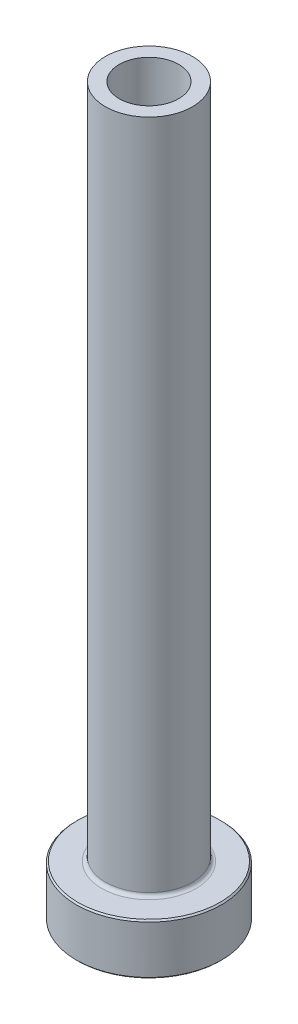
ISO-10303-21;
HEADER;
FILE_DESCRIPTION(('STEP AP214'),'2;1');
FILE_NAME('part.step','',(''),(''),'','','');
FILE_SCHEMA(('AUTOMOTIVE_DESIGN { 1 0 10303 214 1 1 1 1 }'));
ENDSEC;
DATA;
#1=APPLICATION_CONTEXT('core data for automotive mechanical design processes');
#2=APPLICATION_PROTOCOL_DEFINITION('international standard','automotive_design',2000,#1);
#3=PRODUCT_CONTEXT('',#1,'mechanical');
#4=PRODUCT('Part','Part','',(#3));
#5=PRODUCT_RELATED_PRODUCT_CATEGORY('part','',(#4));
#6=PRODUCT_DEFINITION_FORMATION('','',#4);
#7=PRODUCT_DEFINITION_CONTEXT('part definition',#1,'design');
#8=PRODUCT_DEFINITION('design','',#6,#7);
#9=PRODUCT_DEFINITION_SHAPE('','',#8);
#10=(LENGTH_UNIT() NAMED_UNIT(*) SI_UNIT(.MILLI.,.METRE.));
#11=(NAMED_UNIT(*) PLANE_ANGLE_UNIT() SI_UNIT($,.RADIAN.));
#12=(NAMED_UNIT(*) SI_UNIT($,.STERADIAN.) SOLID_ANGLE_UNIT());
#13=UNCERTAINTY_MEASURE_WITH_UNIT(LENGTH_MEASURE(1.E-05),#10,'distance_accuracy_value','');
#14=(GEOMETRIC_REPRESENTATION_CONTEXT(3) GLOBAL_UNCERTAINTY_ASSIGNED_CONTEXT((#13)) GLOBAL_UNIT_ASSIGNED_CONTEXT((#10,
#11,#12)) REPRESENTATION_CONTEXT('',''));
#15=CARTESIAN_POINT('',(0.,0.,0.));
#16=DIRECTION('',(0.,0.,1.));
#17=DIRECTION('',(1.,0.,0.));
#18=AXIS2_PLACEMENT_3D('',#15,#16,#17);
#19=CARTESIAN_POINT('',(0.,92.1876809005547,0.));
#20=DIRECTION('',(0.,1.,0.));
#21=DIRECTION('',(0.,0.,1.));
#22=AXIS2_PLACEMENT_3D('',#19,#20,#21);
#23=CYLINDRICAL_SURFACE('',#22,4.09999999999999);
#24=CARTESIAN_POINT('',(0.,100.,0.));
#25=DIRECTION('',(0.,1.,0.));
#26=DIRECTION('',(0.,0.,1.));
#27=AXIS2_PLACEMENT_3D('',#24,#25,#26);
#28=CIRCLE('',#27,4.09999999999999);
#29=CARTESIAN_POINT('',(0.,100.,4.09999999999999));
#30=VERTEX_POINT('',#29);
#31=EDGE_CURVE('E62',#30,#30,#28,.T.);
#32=ORIENTED_EDGE('',*,*,#31,.T.);
#33=EDGE_LOOP('',(#32));
#34=FACE_BOUND('',#33,.T.);
#35=CARTESIAN_POINT('',(0.,55.,0.));
#36=DIRECTION('',(0.,1.,0.));
#37=DIRECTION('',(0.,0.,1.));
#38=AXIS2_PLACEMENT_3D('',#35,#36,#37);
#39=CIRCLE('',#38,4.09999999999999);
#40=CARTESIAN_POINT('',(0.,55.,4.09999999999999));
#41=VERTEX_POINT('',#40);
#42=EDGE_CURVE('E71',#41,#41,#39,.T.);
#43=ORIENTED_EDGE('',*,*,#42,.F.);
#44=EDGE_LOOP('',(#43));
#45=FACE_BOUND('',#44,.T.);
#46=ADVANCED_FACE('F30',(#34,#45),#23,.F.);
#47=CARTESIAN_POINT('',(-4.09999999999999,100.,0.));
#48=DIRECTION('',(0.,1.,0.));
#49=DIRECTION('',(0.,0.,1.));
#50=AXIS2_PLACEMENT_3D('',#47,#48,#49);
#51=PLANE('',#50);
#52=CARTESIAN_POINT('',(0.,100.,0.));
#53=DIRECTION('',(0.,1.,0.));
#54=DIRECTION('',(0.,0.,1.));
#55=AXIS2_PLACEMENT_3D('',#52,#53,#54);
#56=CIRCLE('',#55,6.);
#57=CARTESIAN_POINT('',(0.,100.,6.));
#58=VERTEX_POINT('',#57);
#59=EDGE_CURVE('E65',#58,#58,#56,.T.);
#60=ORIENTED_EDGE('',*,*,#59,.T.);
#61=EDGE_LOOP('',(#60));
#62=FACE_BOUND('',#61,.T.);
#63=ORIENTED_EDGE('',*,*,#31,.F.);
#64=EDGE_LOOP('',(#63));
#65=FACE_BOUND('',#64,.T.);
#66=ADVANCED_FACE('F79',(#62,#65),#51,.T.);
#67=CARTESIAN_POINT('',(0.,92.1876809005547,0.));
#68=DIRECTION('',(0.,1.,0.));
#69=DIRECTION('',(0.,0.,1.));
#70=AXIS2_PLACEMENT_3D('',#67,#68,#69);
#71=CYLINDRICAL_SURFACE('',#70,6.);
#72=CARTESIAN_POINT('',(0.,7.50000000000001,0.));
#73=DIRECTION('',(0.,1.,0.));
#74=DIRECTION('',(0.,0.,1.));
#75=AXIS2_PLACEMENT_3D('',#72,#73,#74);
#76=CIRCLE('',#75,6.);
#77=CARTESIAN_POINT('',(0.,7.50000000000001,6.));
#78=VERTEX_POINT('',#77);
#79=EDGE_CURVE('E59',#78,#78,#76,.T.);
#80=ORIENTED_EDGE('',*,*,#79,.T.);
#81=EDGE_LOOP('',(#80));
#82=FACE_BOUND('',#81,.T.);
#83=ORIENTED_EDGE('',*,*,#59,.F.);
#84=EDGE_LOOP('',(#83));
#85=FACE_BOUND('',#84,.T.);
#86=ADVANCED_FACE('F85',(#82,#85),#71,.T.);
#87=CARTESIAN_POINT('',(-5.99999999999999,7.,0.));
#88=DIRECTION('',(0.,1.,0.));
#89=DIRECTION('',(0.,0.,1.));
#90=AXIS2_PLACEMENT_3D('',#87,#88,#89);
#91=PLANE('',#90);
#92=CARTESIAN_POINT('',(0.,7.,0.));
#93=DIRECTION('',(0.,1.,0.));
#94=DIRECTION('',(0.,0.,1.));
#95=AXIS2_PLACEMENT_3D('',#92,#93,#94);
#96=CIRCLE('',#95,9.79999999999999);
#97=CARTESIAN_POINT('',(0.,7.,9.79999999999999));
#98=VERTEX_POINT('',#97);
#99=EDGE_CURVE('E53',#98,#98,#96,.T.);
#100=ORIENTED_EDGE('',*,*,#99,.T.);
#101=EDGE_LOOP('',(#100));
#102=FACE_BOUND('',#101,.T.);
#103=CARTESIAN_POINT('',(0.,7.,0.));
#104=DIRECTION('',(0.,1.,0.));
#105=DIRECTION('',(0.,0.,1.));
#106=AXIS2_PLACEMENT_3D('',#103,#104,#105);
#107=CIRCLE('',#106,6.5);
#108=CARTESIAN_POINT('',(0.,7.,6.5));
#109=VERTEX_POINT('',#108);
#110=EDGE_CURVE('E56',#109,#109,#107,.F.);
#111=ORIENTED_EDGE('',*,*,#110,.T.);
#112=EDGE_LOOP('',(#111));
#113=FACE_BOUND('',#112,.T.);
#114=ADVANCED_FACE('F111',(#102,#113),#91,.T.);
#115=CARTESIAN_POINT('',(0.,92.1876809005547,0.));
#116=DIRECTION('',(0.,1.,0.));
#117=DIRECTION('',(0.,0.,1.));
#118=AXIS2_PLACEMENT_3D('',#115,#116,#117);
#119=CYLINDRICAL_SURFACE('',#118,9.99999999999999);
#120=CARTESIAN_POINT('',(0.,6.8,0.));
#121=DIRECTION('',(0.,1.,0.));
#122=DIRECTION('',(0.,0.,1.));
#123=AXIS2_PLACEMENT_3D('',#120,#121,#122);
#124=CIRCLE('',#123,9.99999999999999);
#125=CARTESIAN_POINT('',(0.,6.8,9.99999999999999));
#126=VERTEX_POINT('',#125);
#127=EDGE_CURVE('E45',#126,#126,#124,.F.);
#128=ORIENTED_EDGE('',*,*,#127,.T.);
#129=EDGE_LOOP('',(#128));
#130=FACE_BOUND('',#129,.T.);
#131=CARTESIAN_POINT('',(0.,0.199999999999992,0.));
#132=DIRECTION('',(0.,-1.,0.));
#133=DIRECTION('',(0.,0.,-1.));
#134=AXIS2_PLACEMENT_3D('',#131,#132,#133);
#135=CIRCLE('',#134,9.99999999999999);
#136=CARTESIAN_POINT('',(0.,0.199999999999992,-9.99999999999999));
#137=VERTEX_POINT('',#136);
#138=EDGE_CURVE('E50',#137,#137,#135,.F.);
#139=ORIENTED_EDGE('',*,*,#138,.T.);
#140=EDGE_LOOP('',(#139));
#141=FACE_BOUND('',#140,.T.);
#142=ADVANCED_FACE('F108',(#130,#141),#119,.T.);
#143=CARTESIAN_POINT('',(-9.99999999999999,0.,0.));
#144=DIRECTION('',(0.,-1.,0.));
#145=DIRECTION('',(0.,0.,-1.));
#146=AXIS2_PLACEMENT_3D('',#143,#144,#145);
#147=PLANE('',#146);
#148=CARTESIAN_POINT('',(0.,0.,0.));
#149=DIRECTION('',(0.,-1.,0.));
#150=DIRECTION('',(0.,0.,-1.));
#151=AXIS2_PLACEMENT_3D('',#148,#149,#150);
#152=CIRCLE('',#151,4.85000000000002);
#153=CARTESIAN_POINT('',(0.,0.,-4.85000000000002));
#154=VERTEX_POINT('',#153);
#155=EDGE_CURVE('E37',#154,#154,#152,.F.);
#156=ORIENTED_EDGE('',*,*,#155,.T.);
#157=EDGE_LOOP('',(#156));
#158=FACE_BOUND('',#157,.T.);
#159=CARTESIAN_POINT('',(0.,0.,0.));
#160=DIRECTION('',(0.,-1.,0.));
#161=DIRECTION('',(0.,0.,-1.));
#162=AXIS2_PLACEMENT_3D('',#159,#160,#161);
#163=CIRCLE('',#162,9.79999999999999);
#164=CARTESIAN_POINT('',(0.,0.,-9.79999999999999));
#165=VERTEX_POINT('',#164);
#166=EDGE_CURVE('E41',#165,#165,#163,.T.);
#167=ORIENTED_EDGE('',*,*,#166,.T.);
#168=EDGE_LOOP('',(#167));
#169=FACE_BOUND('',#168,.T.);
#170=ADVANCED_FACE('F110',(#158,#169),#147,.T.);
#171=CARTESIAN_POINT('',(0.,92.1876809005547,0.));
#172=DIRECTION('',(0.,1.,0.));
#173=DIRECTION('',(0.,0.,1.));
#174=AXIS2_PLACEMENT_3D('',#171,#172,#173);
#175=CYLINDRICAL_SURFACE('',#174,4.34999999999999);
#176=CARTESIAN_POINT('',(0.,0.500000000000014,0.));
#177=DIRECTION('',(0.,-1.,0.));
#178=DIRECTION('',(0.,0.,-1.));
#179=AXIS2_PLACEMENT_3D('',#176,#177,#178);
#180=CIRCLE('',#179,4.34999999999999);
#181=CARTESIAN_POINT('',(0.,0.500000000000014,-4.34999999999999));
#182=VERTEX_POINT('',#181);
#183=EDGE_CURVE('E10',#182,#182,#180,.T.);
#184=ORIENTED_EDGE('',*,*,#183,.T.);
#185=EDGE_LOOP('',(#184));
#186=FACE_BOUND('',#185,.T.);
#187=CARTESIAN_POINT('',(0.,43.,0.));
#188=DIRECTION('',(0.,1.,0.));
#189=DIRECTION('',(0.,0.,1.));
#190=AXIS2_PLACEMENT_3D('',#187,#188,#189);
#191=CIRCLE('',#190,4.35);
#192=CARTESIAN_POINT('',(0.,43.,4.35));
#193=VERTEX_POINT('',#192);
#194=EDGE_CURVE('E68',#193,#193,#191,.T.);
#195=ORIENTED_EDGE('',*,*,#194,.T.);
#196=EDGE_LOOP('',(#195));
#197=FACE_BOUND('',#196,.T.);
#198=ADVANCED_FACE('F118',(#186,#197),#175,.F.);
#199=CARTESIAN_POINT('',(0.,43.,0.));
#200=DIRECTION('',(0.,-1.,0.));
#201=DIRECTION('',(0.,0.,-1.));
#202=AXIS2_PLACEMENT_3D('',#199,#200,#201);
#203=CONICAL_SURFACE('',#202,4.35,0.0208303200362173);
#204=ORIENTED_EDGE('',*,*,#42,.T.);
#205=EDGE_LOOP('',(#204));
#206=FACE_BOUND('',#205,.T.);
#207=ORIENTED_EDGE('',*,*,#194,.F.);
#208=EDGE_LOOP('',(#207));
#209=FACE_BOUND('',#208,.T.);
#210=ADVANCED_FACE('F75',(#206,#209),#203,.F.);
#211=CARTESIAN_POINT('',(0.,7.50000000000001,0.));
#212=DIRECTION('',(0.,1.,0.));
#213=DIRECTION('',(0.,0.,1.));
#214=AXIS2_PLACEMENT_3D('',#211,#212,#213);
#215=TOROIDAL_SURFACE('',#214,6.5,0.5);
#216=ORIENTED_EDGE('',*,*,#110,.F.);
#217=EDGE_LOOP('',(#216));
#218=FACE_BOUND('',#217,.T.);
#219=ORIENTED_EDGE('',*,*,#79,.F.);
#220=EDGE_LOOP('',(#219));
#221=FACE_BOUND('',#220,.T.);
#222=ADVANCED_FACE('F90',(#218,#221),#215,.F.);
#223=CARTESIAN_POINT('',(0.,7.00000000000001,0.));
#224=DIRECTION('',(0.,-1.,0.));
#225=DIRECTION('',(0.,0.,-1.));
#226=AXIS2_PLACEMENT_3D('',#223,#224,#225);
#227=CONICAL_SURFACE('',#226,9.79999999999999,0.785398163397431);
#228=ORIENTED_EDGE('',*,*,#127,.F.);
#229=EDGE_LOOP('',(#228));
#230=FACE_BOUND('',#229,.T.);
#231=ORIENTED_EDGE('',*,*,#99,.F.);
#232=EDGE_LOOP('',(#231));
#233=FACE_BOUND('',#232,.T.);
#234=ADVANCED_FACE('F93',(#230,#233),#227,.T.);
#235=CARTESIAN_POINT('',(0.,0.199999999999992,0.));
#236=DIRECTION('',(0.,1.,0.));
#237=DIRECTION('',(0.,0.,1.));
#238=AXIS2_PLACEMENT_3D('',#235,#236,#237);
#239=CONICAL_SURFACE('',#238,9.99999999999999,0.785398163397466);
#240=ORIENTED_EDGE('',*,*,#166,.F.);
#241=EDGE_LOOP('',(#240));
#242=FACE_BOUND('',#241,.T.);
#243=ORIENTED_EDGE('',*,*,#138,.F.);
#244=EDGE_LOOP('',(#243));
#245=FACE_BOUND('',#244,.T.);
#246=ADVANCED_FACE('F96',(#242,#245),#239,.T.);
#247=CARTESIAN_POINT('',(0.,0.,0.));
#248=DIRECTION('',(0.,-1.,0.));
#249=DIRECTION('',(0.,0.,-1.));
#250=AXIS2_PLACEMENT_3D('',#247,#248,#249);
#251=CONICAL_SURFACE('',#250,4.85000000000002,0.785398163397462);
#252=ORIENTED_EDGE('',*,*,#183,.F.);
#253=EDGE_LOOP('',(#252));
#254=FACE_BOUND('',#253,.T.);
#255=ORIENTED_EDGE('',*,*,#155,.F.);
#256=EDGE_LOOP('',(#255));
#257=FACE_BOUND('',#256,.T.);
#258=ADVANCED_FACE('F32',(#254,#257),#251,.F.);
#259=CLOSED_SHELL('',(#46,#66,#86,#114,#142,#170,#198,#210,#222,#234,#246,#258));
#260=MANIFOLD_SOLID_BREP('B2',#259);
#261=ADVANCED_BREP_SHAPE_REPRESENTATION('',(#18,#260),#14);
#262=SHAPE_DEFINITION_REPRESENTATION(#9,#261);
ENDSEC;
END-ISO-10303-21;
